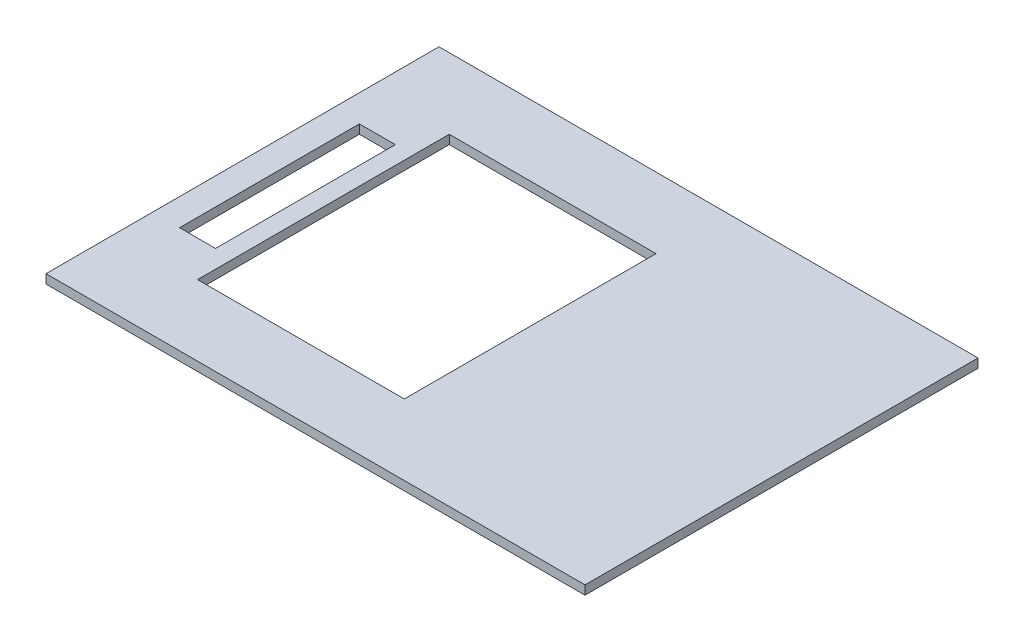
from build123d import *

# Parameters (mm, degrees)
SKETCH1_W           = 299.8
SKETCH1_H           = 218.6
BOSS_EXTRUDE1_DEPTH = 5
SKETCH2_W           = 20
SKETCH2_H           = 100
CUT_EXTRUDE1_DEPTH  = 5
SKETCH3_W           = 115
SKETCH3_H           = 140
CUT_EXTRUDE2_DEPTH  = 10


with BuildPart() as part:
    # Sketch1 → Boss-Extrude1 (new body)
    with BuildSketch(Plane(origin=(0, 0, 0), x_dir=(1, 0, 0), z_dir=(0, 1, 0))):
        Rectangle(SKETCH1_W, SKETCH1_H)
    extrude(amount=BOSS_EXTRUDE1_DEPTH)

    # Sketch2 → Cut-Extrude1 (cut)
    with BuildSketch(Plane(origin=(0, 5, 0), x_dir=(1, 0, 0), z_dir=(0, 1, 0))):
        with Locations((-124.9, 0)):
            Rectangle(SKETCH2_W, SKETCH2_H)
    extrude(amount=-CUT_EXTRUDE1_DEPTH, mode=Mode.SUBTRACT)

    # Sketch3 → Cut-Extrude2 (cut)
    with BuildSketch(Plane(origin=(0, 5, 0), x_dir=(1, 0, 0), z_dir=(0, 1, 0))):
        with Locations((-47.4, 0)):
            Rectangle(SKETCH3_W, SKETCH3_H)
    extrude(amount=-CUT_EXTRUDE2_DEPTH, mode=Mode.SUBTRACT)


solid = part.part
